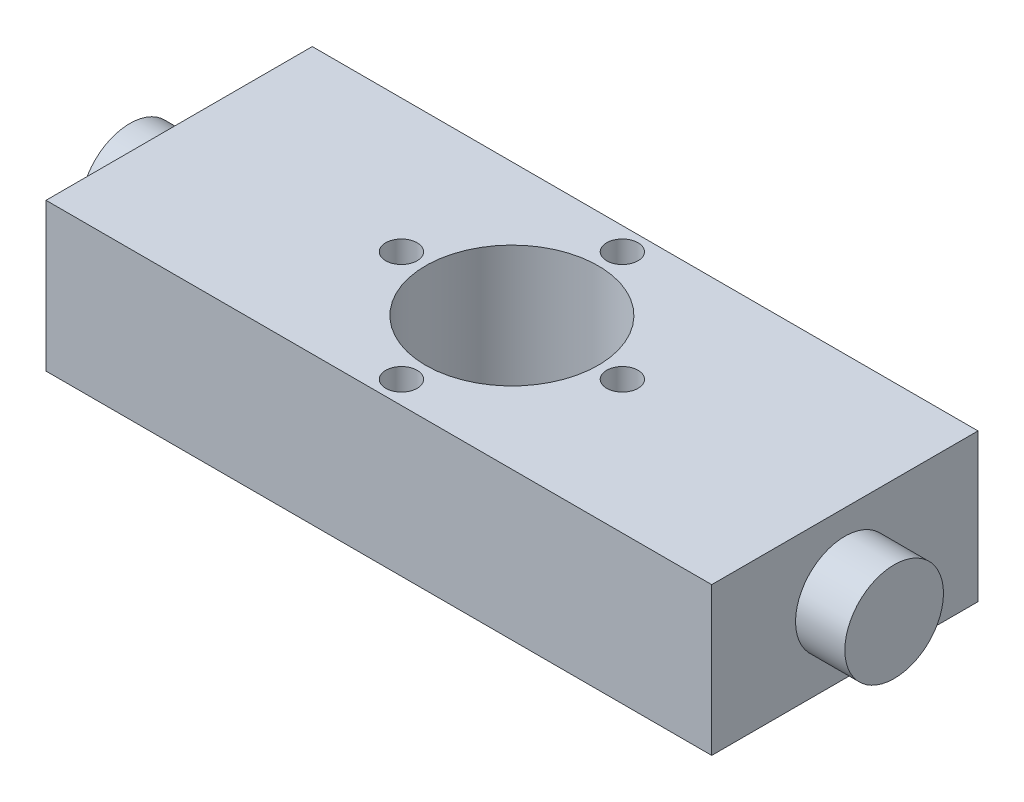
from build123d import *

# Parameters (mm, degrees)
SKETCH1_W           = 85.725
SKETCH1_H           = 34.29
EXTRUDE1_DEPTH      = 19.05
EXTRUDE2_DEPTH      = 6.35
EXTRUDE2_DEPTH_BACK = 92.075
SKETCH3_R           = 6.35
SKETCH2_R           = 11.1125
CUT_EXTRUDE1_DEPTH  = 101.082527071
CIRPATTERN1_COUNT   = 4


with BuildPart() as part:
    # Sketch1 → Extrude1 (new body)
    with BuildSketch(Plane(origin=(0, 0, 0), x_dir=(1, 0, 0), z_dir=(0, 1, 0))):
        with Locations((42.8625, 17.145)):
            Rectangle(SKETCH1_W, SKETCH1_H)
    extrude(amount=EXTRUDE1_DEPTH)

    # Sketch3 → Extrude2 (add, two sides: drawn at the far end of the back side and taken through both)
    with BuildSketch(Plane(origin=(85.725, 0, 0), x_dir=(0, 0, -1), z_dir=(1, 0, 0)).offset(-EXTRUDE2_DEPTH_BACK)):
        with Locations(Location((17.145, 9.525, 0), (0, 0, 180))):
            Circle(SKETCH3_R)
    extrude(amount=EXTRUDE2_DEPTH + EXTRUDE2_DEPTH_BACK)

    # Sketch2 → Cut-Extrude1 (cut, through all)
    with BuildSketch(Plane(origin=(0, 19.05, 0), x_dir=(-1, 0, 0), z_dir=(0, 1, 0))):
        with Locations(Location((-42.8498, -17.145, 0), (0, 0, 90))):
            Circle(SKETCH2_R)
    extrude(amount=-CUT_EXTRUDE1_DEPTH, mode=Mode.SUBTRACT)

    # Sketch4 → 10-32 Tapped Hole1 (revolve, cut)
    with BuildSketch(Plane(origin=(42.8498, 19.05, -2.921), x_dir=(0, 0, 1), z_dir=(1, 0, 0))):
        Polygon((0, 0), (0, 14.929317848), (2.0193, 13.716), (2.0193, 0), align=None)
    f_10_32_tapped_hole1 = revolve(axis=Axis((42.8498, 25.4, -2.921), (0, -1, 0)), mode=Mode.SUBTRACT)

    # CirPattern1: 10-32 Tapped Hole1 ×4 about axis
    cirpattern1_axis = Axis((42.8498, 0, -17.145), (0, 1, 0))
    for i in range(1, CIRPATTERN1_COUNT):
        add(f_10_32_tapped_hole1.rotate(cirpattern1_axis, i * 360 / CIRPATTERN1_COUNT), mode=Mode.SUBTRACT)


solid = part.part
